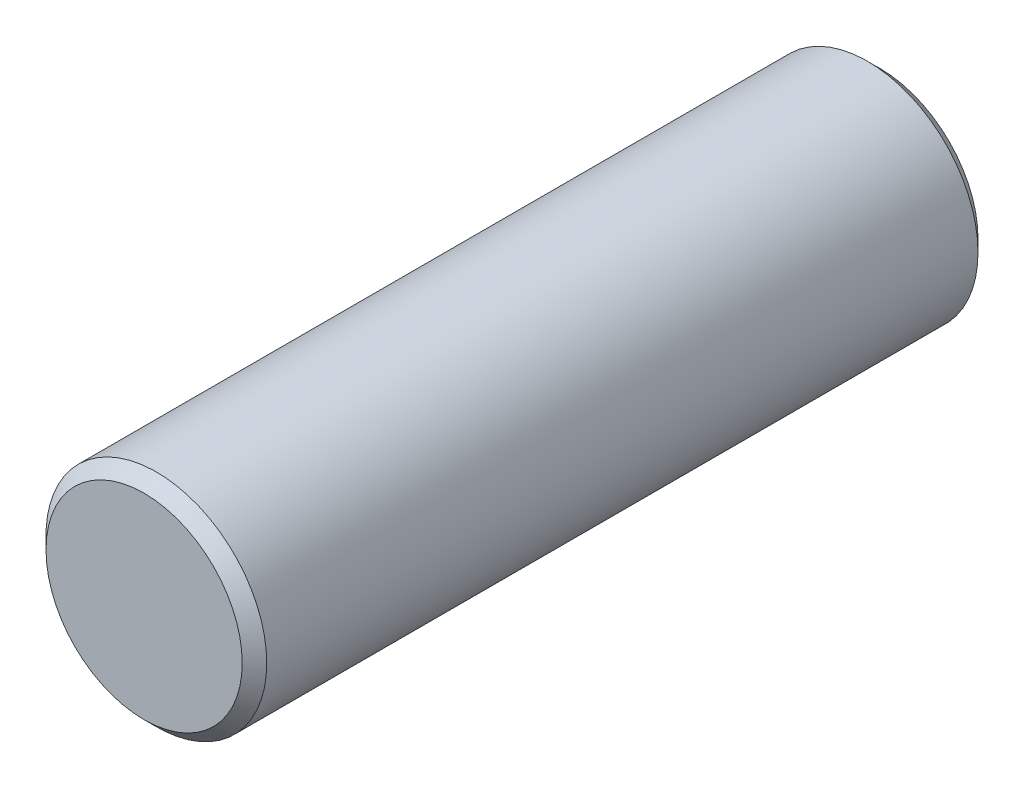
from build123d import *

# Parameters (mm, degrees)
ESQUISSE1_R        = 9
BOSS_EXTRU_1_DEPTH = 60
CHANFREIN1_SIZE    = 1


with BuildPart() as part:
    # Esquisse1 → Boss.-Extru.1 (new body)
    with BuildSketch(Plane.XY):
        Circle(ESQUISSE1_R)
    extrude(amount=BOSS_EXTRU_1_DEPTH)

    # Chanfrein1
    chanfrein1_edges = [part.edges().sort_by_distance(p)[0] for p in [
        (-9, 0, 0),
        (-9, 0, 60),
    ]]
    chamfer(chanfrein1_edges, length=CHANFREIN1_SIZE)


solid = part.part
